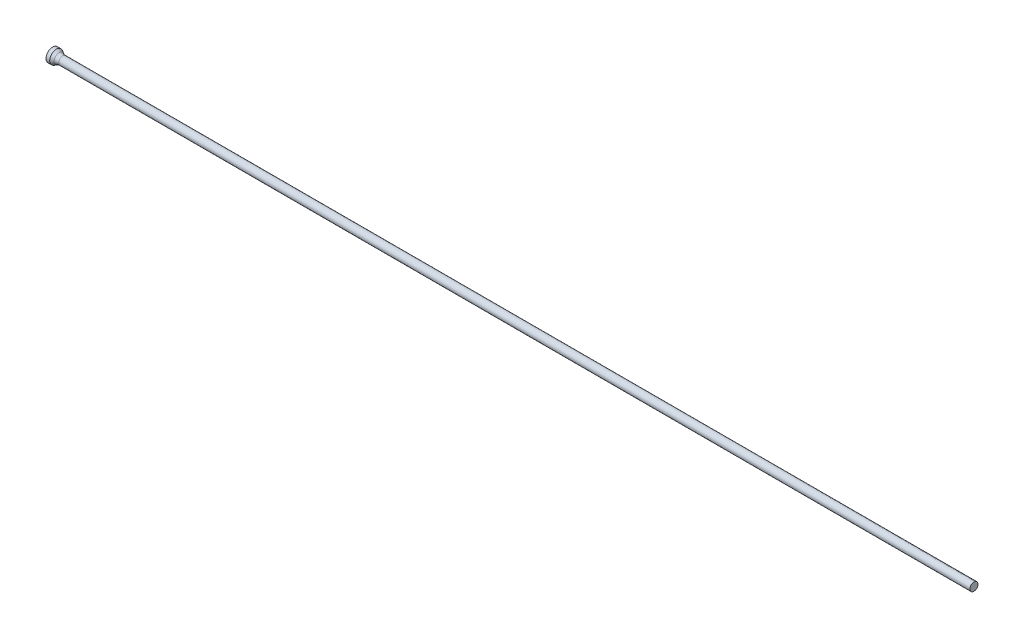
ISO-10303-21;
HEADER;
FILE_DESCRIPTION(('STEP AP214'),'2;1');
FILE_NAME('part.step','',(''),(''),'','','');
FILE_SCHEMA(('AUTOMOTIVE_DESIGN { 1 0 10303 214 1 1 1 1 }'));
ENDSEC;
DATA;
#1=APPLICATION_CONTEXT('core data for automotive mechanical design processes');
#2=APPLICATION_PROTOCOL_DEFINITION('international standard','automotive_design',2000,#1);
#3=PRODUCT_CONTEXT('',#1,'mechanical');
#4=PRODUCT('Part','Part','',(#3));
#5=PRODUCT_RELATED_PRODUCT_CATEGORY('part','',(#4));
#6=PRODUCT_DEFINITION_FORMATION('','',#4);
#7=PRODUCT_DEFINITION_CONTEXT('part definition',#1,'design');
#8=PRODUCT_DEFINITION('design','',#6,#7);
#9=PRODUCT_DEFINITION_SHAPE('','',#8);
#10=(LENGTH_UNIT() NAMED_UNIT(*) SI_UNIT(.MILLI.,.METRE.));
#11=(NAMED_UNIT(*) PLANE_ANGLE_UNIT() SI_UNIT($,.RADIAN.));
#12=(NAMED_UNIT(*) SI_UNIT($,.STERADIAN.) SOLID_ANGLE_UNIT());
#13=UNCERTAINTY_MEASURE_WITH_UNIT(LENGTH_MEASURE(1.E-05),#10,'distance_accuracy_value','');
#14=(GEOMETRIC_REPRESENTATION_CONTEXT(3) GLOBAL_UNCERTAINTY_ASSIGNED_CONTEXT((#13)) GLOBAL_UNIT_ASSIGNED_CONTEXT((#10,
#11,#12)) REPRESENTATION_CONTEXT('',''));
#15=CARTESIAN_POINT('',(0.,0.,0.));
#16=DIRECTION('',(0.,0.,1.));
#17=DIRECTION('',(1.,0.,0.));
#18=AXIS2_PLACEMENT_3D('',#15,#16,#17);
#19=CARTESIAN_POINT('',(0.,0.,0.));
#20=DIRECTION('',(1.,0.,0.));
#21=DIRECTION('',(0.,0.,-1.));
#22=AXIS2_PLACEMENT_3D('',#19,#20,#21);
#23=PLANE('',#22);
#24=CARTESIAN_POINT('',(0.,0.,0.));
#25=DIRECTION('',(-1.,0.,0.));
#26=DIRECTION('',(0.,0.,1.));
#27=AXIS2_PLACEMENT_3D('',#24,#25,#26);
#28=CIRCLE('',#27,0.9);
#29=CARTESIAN_POINT('',(0.,0.,0.9));
#30=VERTEX_POINT('',#29);
#31=EDGE_CURVE('E25',#30,#30,#28,.T.);
#32=ORIENTED_EDGE('',*,*,#31,.T.);
#33=EDGE_LOOP('',(#32));
#34=FACE_BOUND('',#33,.T.);
#35=ADVANCED_FACE('F14',(#34),#23,.F.);
#36=CARTESIAN_POINT('',(0.,0.,0.));
#37=DIRECTION('',(-1.,0.,0.));
#38=DIRECTION('',(0.,0.,1.));
#39=AXIS2_PLACEMENT_3D('',#36,#37,#38);
#40=CYLINDRICAL_SURFACE('',#39,0.9);
#41=ORIENTED_EDGE('',*,*,#31,.F.);
#42=EDGE_LOOP('',(#41));
#43=FACE_BOUND('',#42,.T.);
#44=CARTESIAN_POINT('',(0.503782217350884,0.,0.));
#45=DIRECTION('',(-1.,0.,0.));
#46=DIRECTION('',(0.,0.,1.));
#47=AXIS2_PLACEMENT_3D('',#44,#45,#46);
#48=CIRCLE('',#47,0.9);
#49=CARTESIAN_POINT('',(0.503782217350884,0.,0.9));
#50=VERTEX_POINT('',#49);
#51=EDGE_CURVE('E29',#50,#50,#48,.T.);
#52=ORIENTED_EDGE('',*,*,#51,.T.);
#53=EDGE_LOOP('',(#52));
#54=FACE_BOUND('',#53,.T.);
#55=ADVANCED_FACE('F53',(#43,#54),#40,.T.);
#56=CARTESIAN_POINT('',(1.11,0.,0.));
#57=DIRECTION('',(-1.,0.,0.));
#58=DIRECTION('',(0.,0.,1.));
#59=AXIS2_PLACEMENT_3D('',#56,#57,#58);
#60=CONICAL_SURFACE('',#59,0.55,0.523598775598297);
#61=CARTESIAN_POINT('',(0.877949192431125,0.,0.));
#62=DIRECTION('',(-1.,0.,0.));
#63=DIRECTION('',(0.,0.,1.));
#64=AXIS2_PLACEMENT_3D('',#61,#62,#63);
#65=CIRCLE('',#64,0.683974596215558);
#66=CARTESIAN_POINT('',(0.877949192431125,0.,0.683974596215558));
#67=VERTEX_POINT('',#66);
#68=EDGE_CURVE('E21',#67,#67,#65,.T.);
#69=ORIENTED_EDGE('',*,*,#68,.T.);
#70=EDGE_LOOP('',(#69));
#71=FACE_BOUND('',#70,.T.);
#72=ORIENTED_EDGE('',*,*,#51,.F.);
#73=EDGE_LOOP('',(#72));
#74=FACE_BOUND('',#73,.T.);
#75=ADVANCED_FACE('F50',(#71,#74),#60,.T.);
#76=CARTESIAN_POINT('',(0.,0.,0.));
#77=DIRECTION('',(-1.,0.,0.));
#78=DIRECTION('',(0.,0.,1.));
#79=AXIS2_PLACEMENT_3D('',#76,#77,#78);
#80=CYLINDRICAL_SURFACE('',#79,0.55);
#81=CARTESIAN_POINT('',(1.37794919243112,0.,0.));
#82=DIRECTION('',(-1.,0.,0.));
#83=DIRECTION('',(0.,0.,1.));
#84=AXIS2_PLACEMENT_3D('',#81,#82,#83);
#85=CIRCLE('',#84,0.55);
#86=CARTESIAN_POINT('',(1.37794919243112,0.,0.55));
#87=VERTEX_POINT('',#86);
#88=EDGE_CURVE('E9',#87,#87,#85,.F.);
#89=ORIENTED_EDGE('',*,*,#88,.T.);
#90=EDGE_LOOP('',(#89));
#91=FACE_BOUND('',#90,.T.);
#92=CARTESIAN_POINT('',(125.,0.,0.));
#93=DIRECTION('',(-1.,0.,0.));
#94=DIRECTION('',(0.,0.,1.));
#95=AXIS2_PLACEMENT_3D('',#92,#93,#94);
#96=CIRCLE('',#95,0.55);
#97=CARTESIAN_POINT('',(125.,0.,0.55));
#98=VERTEX_POINT('',#97);
#99=EDGE_CURVE('E34',#98,#98,#96,.T.);
#100=ORIENTED_EDGE('',*,*,#99,.T.);
#101=EDGE_LOOP('',(#100));
#102=FACE_BOUND('',#101,.T.);
#103=ADVANCED_FACE('F38',(#91,#102),#80,.T.);
#104=CARTESIAN_POINT('',(125.,0.55,0.));
#105=DIRECTION('',(-1.,0.,0.));
#106=DIRECTION('',(0.,0.,1.));
#107=AXIS2_PLACEMENT_3D('',#104,#105,#106);
#108=PLANE('',#107);
#109=ORIENTED_EDGE('',*,*,#99,.F.);
#110=EDGE_LOOP('',(#109));
#111=FACE_BOUND('',#110,.T.);
#112=ADVANCED_FACE('F40',(#111),#108,.F.);
#113=CARTESIAN_POINT('',(1.37794919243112,0.,0.));
#114=DIRECTION('',(-1.,0.,0.));
#115=DIRECTION('',(0.,0.,1.));
#116=AXIS2_PLACEMENT_3D('',#113,#114,#115);
#117=TOROIDAL_SURFACE('',#116,1.55,1.);
#118=ORIENTED_EDGE('',*,*,#88,.F.);
#119=EDGE_LOOP('',(#118));
#120=FACE_BOUND('',#119,.T.);
#121=ORIENTED_EDGE('',*,*,#68,.F.);
#122=EDGE_LOOP('',(#121));
#123=FACE_BOUND('',#122,.T.);
#124=ADVANCED_FACE('F16',(#120,#123),#117,.F.);
#125=CLOSED_SHELL('',(#35,#55,#75,#103,#112,#124));
#126=MANIFOLD_SOLID_BREP('B1',#125);
#127=ADVANCED_BREP_SHAPE_REPRESENTATION('',(#18,#126),#14);
#128=SHAPE_DEFINITION_REPRESENTATION(#9,#127);
ENDSEC;
END-ISO-10303-21;
